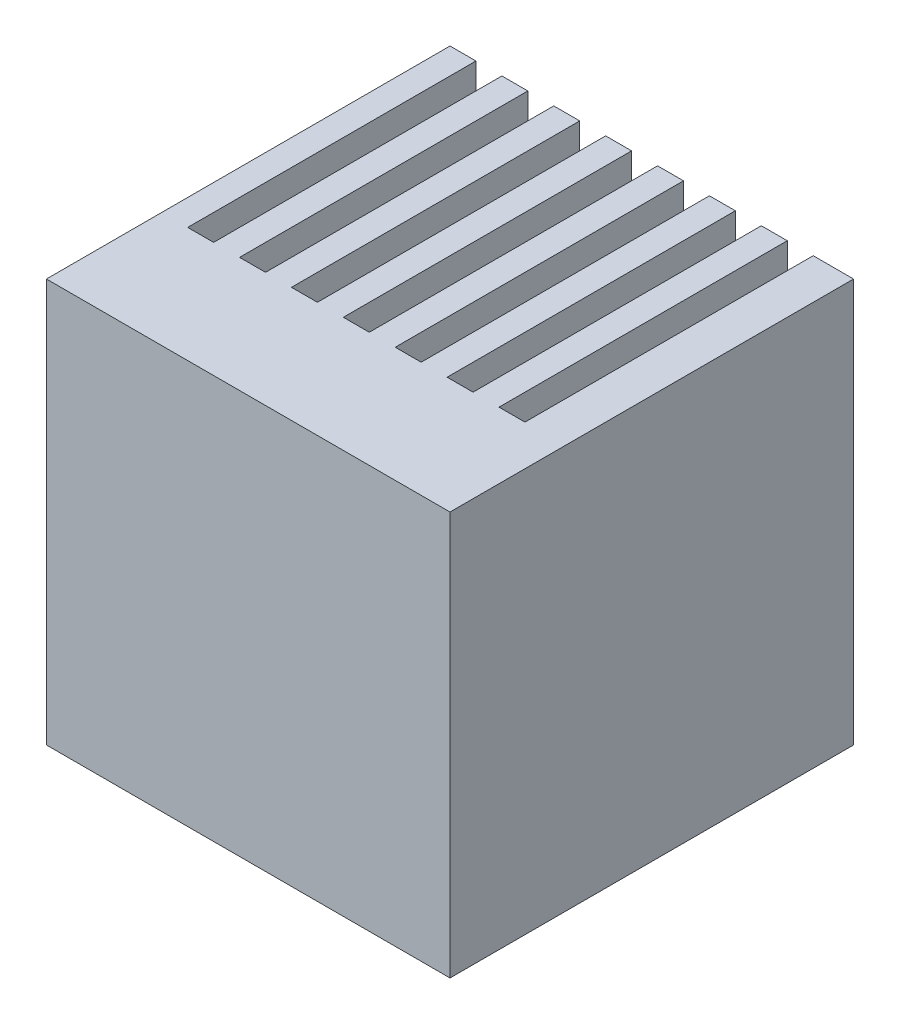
from build123d import *

# Parameters (mm, degrees)
SKETCH_2_W             = 28
SKETCH_2_H             = 28
EXTRUDE_1_DEPTH        = 28
SKETCH_3_W             = 1.8
SKETCH_3_H             = 20
CUT_EXTRUDE_1_DEPTH    = 49.497422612
PATTERN_LINEAR_6_COUNT = 7
PATTERN_LINEAR_6_PITCH = 3.6


with BuildPart() as part:
    # Sketch 2 → Extrude 1 (new body)
    with BuildSketch(Plane(origin=(0, 0, 0), x_dir=(1, 0, 0), z_dir=(0, 1, 0))):
        with Locations((14, -14)):
            Rectangle(SKETCH_2_W, SKETCH_2_H)
    extrude(amount=EXTRUDE_1_DEPTH)

    # Sketch 3 → Cut-Extrude 1 (cut, through all)
    with BuildSketch(Plane(origin=(0, 28, 0), x_dir=(1, 0, 0), z_dir=(0, 1, 0))):
        with Locations((2.7, -10)):
            Rectangle(SKETCH_3_W, SKETCH_3_H)
    cut_extrude_1 = extrude(amount=-CUT_EXTRUDE_1_DEPTH, mode=Mode.SUBTRACT)

    # Pattern Linear 6: Cut-Extrude 1 ×7
    with Locations(*[(i * PATTERN_LINEAR_6_PITCH, 0, 0) for i in range(1, PATTERN_LINEAR_6_COUNT)]):
        add(cut_extrude_1, mode=Mode.SUBTRACT)


solid = part.part
